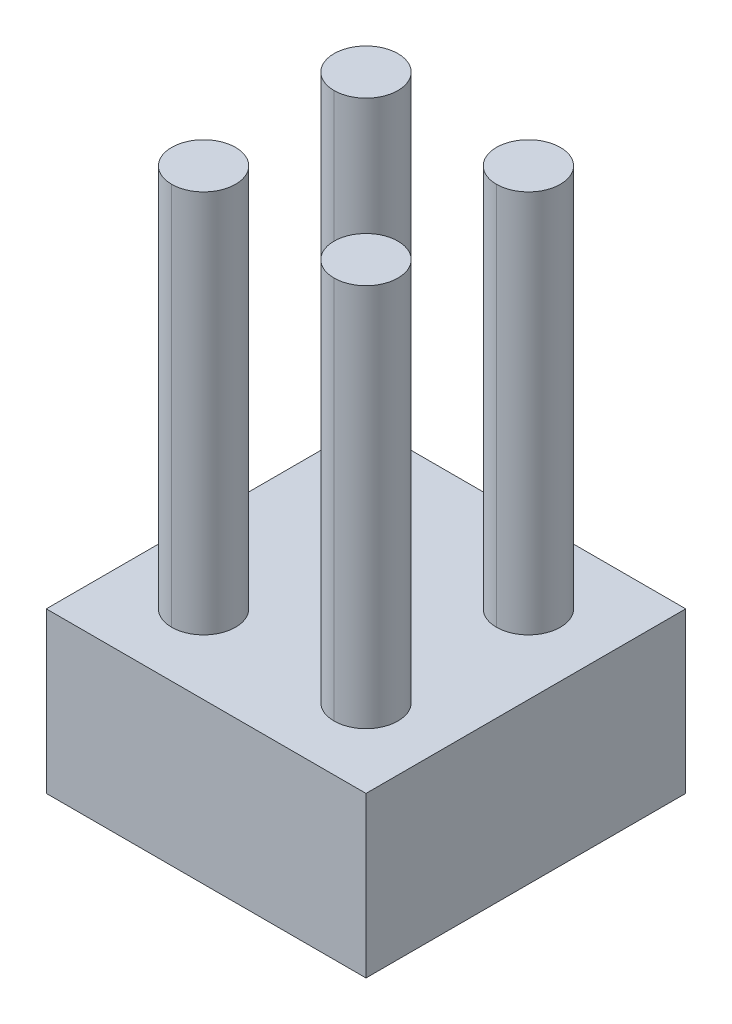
ISO-10303-21;
HEADER;
FILE_DESCRIPTION(('STEP AP214'),'2;1');
FILE_NAME('part.step','',(''),(''),'','','');
FILE_SCHEMA(('AUTOMOTIVE_DESIGN { 1 0 10303 214 1 1 1 1 }'));
ENDSEC;
DATA;
#1=APPLICATION_CONTEXT('core data for automotive mechanical design processes');
#2=APPLICATION_PROTOCOL_DEFINITION('international standard','automotive_design',2000,#1);
#3=PRODUCT_CONTEXT('',#1,'mechanical');
#4=PRODUCT('Part','Part','',(#3));
#5=PRODUCT_RELATED_PRODUCT_CATEGORY('part','',(#4));
#6=PRODUCT_DEFINITION_FORMATION('','',#4);
#7=PRODUCT_DEFINITION_CONTEXT('part definition',#1,'design');
#8=PRODUCT_DEFINITION('design','',#6,#7);
#9=PRODUCT_DEFINITION_SHAPE('','',#8);
#10=(LENGTH_UNIT() NAMED_UNIT(*) SI_UNIT(.MILLI.,.METRE.));
#11=(NAMED_UNIT(*) PLANE_ANGLE_UNIT() SI_UNIT($,.RADIAN.));
#12=(NAMED_UNIT(*) SI_UNIT($,.STERADIAN.) SOLID_ANGLE_UNIT());
#13=UNCERTAINTY_MEASURE_WITH_UNIT(LENGTH_MEASURE(1.E-05),#10,'distance_accuracy_value','');
#14=(GEOMETRIC_REPRESENTATION_CONTEXT(3) GLOBAL_UNCERTAINTY_ASSIGNED_CONTEXT((#13)) GLOBAL_UNIT_ASSIGNED_CONTEXT((#10,
#11,#12)) REPRESENTATION_CONTEXT('',''));
#15=CARTESIAN_POINT('',(0.,0.,0.));
#16=DIRECTION('',(0.,0.,1.));
#17=DIRECTION('',(1.,0.,0.));
#18=AXIS2_PLACEMENT_3D('',#15,#16,#17);
#19=CARTESIAN_POINT('',(1.27,8.5,-1.27));
#20=DIRECTION('',(0.,-1.,0.));
#21=DIRECTION('',(0.,0.,-1.));
#22=AXIS2_PLACEMENT_3D('',#19,#20,#21);
#23=PLANE('',#22);
#24=CARTESIAN_POINT('',(1.27,8.5,-1.27));
#25=DIRECTION('',(0.,1.,0.));
#26=DIRECTION('',(0.,0.,-1.));
#27=AXIS2_PLACEMENT_3D('',#24,#25,#26);
#28=CIRCLE('',#27,0.5);
#29=CARTESIAN_POINT('',(1.27,8.5,-1.77));
#30=VERTEX_POINT('',#29);
#31=CARTESIAN_POINT('',(1.27,8.5,-0.77));
#32=VERTEX_POINT('',#31);
#33=EDGE_CURVE('E11',#30,#32,#28,.T.);
#34=ORIENTED_EDGE('',*,*,#33,.T.);
#35=CARTESIAN_POINT('',(1.27,8.5,-1.27));
#36=DIRECTION('',(0.,1.,0.));
#37=DIRECTION('',(0.,0.,-1.));
#38=AXIS2_PLACEMENT_3D('',#35,#36,#37);
#39=CIRCLE('',#38,0.5);
#40=EDGE_CURVE('E139',#32,#30,#39,.T.);
#41=ORIENTED_EDGE('',*,*,#40,.T.);
#42=EDGE_LOOP('',(#34,#41));
#43=FACE_BOUND('',#42,.T.);
#44=ADVANCED_FACE('F17',(#43),#23,.F.);
#45=CARTESIAN_POINT('',(1.27,8.5,-1.27));
#46=DIRECTION('',(0.,-1.,0.));
#47=DIRECTION('',(0.,0.,-1.));
#48=AXIS2_PLACEMENT_3D('',#45,#46,#47);
#49=CYLINDRICAL_SURFACE('',#48,0.5);
#50=DIRECTION('',(0.,-1.,0.));
#51=VECTOR('',#50,1.);
#52=CARTESIAN_POINT('',(1.27,8.5,-0.77));
#53=LINE('',#52,#51);
#54=CARTESIAN_POINT('',(1.27,2.5,-0.77));
#55=VERTEX_POINT('',#54);
#56=EDGE_CURVE('E144',#32,#55,#53,.T.);
#57=ORIENTED_EDGE('',*,*,#56,.F.);
#58=ORIENTED_EDGE('',*,*,#33,.F.);
#59=DIRECTION('',(0.,-1.,0.));
#60=VECTOR('',#59,1.);
#61=CARTESIAN_POINT('',(1.27,8.5,-1.77));
#62=LINE('',#61,#60);
#63=CARTESIAN_POINT('',(1.27,2.5,-1.77));
#64=VERTEX_POINT('',#63);
#65=EDGE_CURVE('E154',#30,#64,#62,.T.);
#66=ORIENTED_EDGE('',*,*,#65,.T.);
#67=CARTESIAN_POINT('',(1.27,2.5,-1.27));
#68=DIRECTION('',(0.,1.,0.));
#69=DIRECTION('',(0.,0.,-1.));
#70=AXIS2_PLACEMENT_3D('',#67,#68,#69);
#71=CIRCLE('',#70,0.5);
#72=EDGE_CURVE('E146',#64,#55,#71,.T.);
#73=ORIENTED_EDGE('',*,*,#72,.T.);
#74=EDGE_LOOP('',(#57,#58,#66,#73));
#75=FACE_BOUND('',#74,.T.);
#76=ADVANCED_FACE('F145',(#75),#49,.T.);
#77=CARTESIAN_POINT('',(1.27,8.5,1.27));
#78=DIRECTION('',(0.,1.,0.));
#79=DIRECTION('',(1.,0.,0.));
#80=AXIS2_PLACEMENT_3D('',#77,#78,#79);
#81=PLANE('',#80);
#82=CARTESIAN_POINT('',(1.27,8.5,1.27));
#83=DIRECTION('',(0.,1.,0.));
#84=DIRECTION('',(0.,0.,1.));
#85=AXIS2_PLACEMENT_3D('',#82,#83,#84);
#86=CIRCLE('',#85,0.5);
#87=CARTESIAN_POINT('',(1.27,8.5,0.77));
#88=VERTEX_POINT('',#87);
#89=CARTESIAN_POINT('',(1.27,8.5,1.77));
#90=VERTEX_POINT('',#89);
#91=EDGE_CURVE('E25',#88,#90,#86,.T.);
#92=ORIENTED_EDGE('',*,*,#91,.T.);
#93=CARTESIAN_POINT('',(1.27,8.5,1.27));
#94=DIRECTION('',(0.,1.,0.));
#95=DIRECTION('',(0.,0.,1.));
#96=AXIS2_PLACEMENT_3D('',#93,#94,#95);
#97=CIRCLE('',#96,0.5);
#98=EDGE_CURVE('E161',#90,#88,#97,.T.);
#99=ORIENTED_EDGE('',*,*,#98,.T.);
#100=EDGE_LOOP('',(#92,#99));
#101=FACE_BOUND('',#100,.T.);
#102=ADVANCED_FACE('F275',(#101),#81,.T.);
#103=CARTESIAN_POINT('',(1.27,8.5,1.27));
#104=DIRECTION('',(0.,-1.,0.));
#105=DIRECTION('',(0.,0.,-1.));
#106=AXIS2_PLACEMENT_3D('',#103,#104,#105);
#107=CYLINDRICAL_SURFACE('',#106,0.5);
#108=DIRECTION('',(0.,-1.,0.));
#109=VECTOR('',#108,1.);
#110=CARTESIAN_POINT('',(1.27,8.5,1.77));
#111=LINE('',#110,#109);
#112=CARTESIAN_POINT('',(1.27,2.5,1.77));
#113=VERTEX_POINT('',#112);
#114=EDGE_CURVE('E168',#90,#113,#111,.T.);
#115=ORIENTED_EDGE('',*,*,#114,.F.);
#116=ORIENTED_EDGE('',*,*,#91,.F.);
#117=DIRECTION('',(0.,-1.,0.));
#118=VECTOR('',#117,1.);
#119=CARTESIAN_POINT('',(1.27,8.5,0.77));
#120=LINE('',#119,#118);
#121=CARTESIAN_POINT('',(1.27,2.5,0.77));
#122=VERTEX_POINT('',#121);
#123=EDGE_CURVE('E186',#88,#122,#120,.T.);
#124=ORIENTED_EDGE('',*,*,#123,.T.);
#125=CARTESIAN_POINT('',(1.27,2.5,1.27));
#126=DIRECTION('',(0.,1.,0.));
#127=DIRECTION('',(0.,0.,-1.));
#128=AXIS2_PLACEMENT_3D('',#125,#126,#127);
#129=CIRCLE('',#128,0.5);
#130=EDGE_CURVE('E256',#122,#113,#129,.T.);
#131=ORIENTED_EDGE('',*,*,#130,.T.);
#132=EDGE_LOOP('',(#115,#116,#124,#131));
#133=FACE_BOUND('',#132,.T.);
#134=ADVANCED_FACE('F279',(#133),#107,.T.);
#135=CARTESIAN_POINT('',(-1.27,8.5,1.27));
#136=DIRECTION('',(0.,-1.,0.));
#137=DIRECTION('',(0.,0.,-1.));
#138=AXIS2_PLACEMENT_3D('',#135,#136,#137);
#139=PLANE('',#138);
#140=CARTESIAN_POINT('',(-1.27,8.5,1.27));
#141=DIRECTION('',(0.,1.,0.));
#142=DIRECTION('',(0.,0.,-1.));
#143=AXIS2_PLACEMENT_3D('',#140,#141,#142);
#144=CIRCLE('',#143,0.5);
#145=CARTESIAN_POINT('',(-1.27,8.5,0.77));
#146=VERTEX_POINT('',#145);
#147=CARTESIAN_POINT('',(-1.27,8.5,1.77));
#148=VERTEX_POINT('',#147);
#149=EDGE_CURVE('E268',#146,#148,#144,.T.);
#150=ORIENTED_EDGE('',*,*,#149,.T.);
#151=CARTESIAN_POINT('',(-1.27,8.5,1.27));
#152=DIRECTION('',(0.,1.,0.));
#153=DIRECTION('',(0.,0.,-1.));
#154=AXIS2_PLACEMENT_3D('',#151,#152,#153);
#155=CIRCLE('',#154,0.5);
#156=EDGE_CURVE('E190',#148,#146,#155,.T.);
#157=ORIENTED_EDGE('',*,*,#156,.T.);
#158=EDGE_LOOP('',(#150,#157));
#159=FACE_BOUND('',#158,.T.);
#160=ADVANCED_FACE('F324',(#159),#139,.F.);
#161=CARTESIAN_POINT('',(-1.27,8.5,1.27));
#162=DIRECTION('',(0.,-1.,0.));
#163=DIRECTION('',(0.,0.,-1.));
#164=AXIS2_PLACEMENT_3D('',#161,#162,#163);
#165=CYLINDRICAL_SURFACE('',#164,0.5);
#166=DIRECTION('',(0.,-1.,0.));
#167=VECTOR('',#166,1.);
#168=CARTESIAN_POINT('',(-1.27,8.5,1.77));
#169=LINE('',#168,#167);
#170=CARTESIAN_POINT('',(-1.27,2.5,1.77));
#171=VERTEX_POINT('',#170);
#172=EDGE_CURVE('E194',#148,#171,#169,.T.);
#173=ORIENTED_EDGE('',*,*,#172,.F.);
#174=ORIENTED_EDGE('',*,*,#149,.F.);
#175=DIRECTION('',(0.,-1.,0.));
#176=VECTOR('',#175,1.);
#177=CARTESIAN_POINT('',(-1.27,8.5,0.77));
#178=LINE('',#177,#176);
#179=CARTESIAN_POINT('',(-1.27,2.5,0.77));
#180=VERTEX_POINT('',#179);
#181=EDGE_CURVE('E205',#146,#180,#178,.T.);
#182=ORIENTED_EDGE('',*,*,#181,.T.);
#183=CARTESIAN_POINT('',(-1.27,2.5,1.27));
#184=DIRECTION('',(0.,1.,0.));
#185=DIRECTION('',(0.,0.,-1.));
#186=AXIS2_PLACEMENT_3D('',#183,#184,#185);
#187=CIRCLE('',#186,0.5);
#188=EDGE_CURVE('E259',#180,#171,#187,.T.);
#189=ORIENTED_EDGE('',*,*,#188,.T.);
#190=EDGE_LOOP('',(#173,#174,#182,#189));
#191=FACE_BOUND('',#190,.T.);
#192=ADVANCED_FACE('F322',(#191),#165,.T.);
#193=CARTESIAN_POINT('',(-1.27,8.5,-1.27));
#194=DIRECTION('',(0.,1.,0.));
#195=DIRECTION('',(1.,0.,0.));
#196=AXIS2_PLACEMENT_3D('',#193,#194,#195);
#197=PLANE('',#196);
#198=CARTESIAN_POINT('',(-1.27,8.5,-1.27));
#199=DIRECTION('',(0.,1.,0.));
#200=DIRECTION('',(0.,0.,1.));
#201=AXIS2_PLACEMENT_3D('',#198,#199,#200);
#202=CIRCLE('',#201,0.5);
#203=CARTESIAN_POINT('',(-1.27,8.5,-1.77));
#204=VERTEX_POINT('',#203);
#205=CARTESIAN_POINT('',(-1.27,8.5,-0.77));
#206=VERTEX_POINT('',#205);
#207=EDGE_CURVE('E265',#204,#206,#202,.T.);
#208=ORIENTED_EDGE('',*,*,#207,.T.);
#209=CARTESIAN_POINT('',(-1.27,8.5,-1.27));
#210=DIRECTION('',(0.,1.,0.));
#211=DIRECTION('',(0.,0.,1.));
#212=AXIS2_PLACEMENT_3D('',#209,#210,#211);
#213=CIRCLE('',#212,0.5);
#214=EDGE_CURVE('E215',#206,#204,#213,.T.);
#215=ORIENTED_EDGE('',*,*,#214,.T.);
#216=EDGE_LOOP('',(#208,#215));
#217=FACE_BOUND('',#216,.T.);
#218=ADVANCED_FACE('F309',(#217),#197,.T.);
#219=CARTESIAN_POINT('',(-1.27,8.5,-1.27));
#220=DIRECTION('',(0.,-1.,0.));
#221=DIRECTION('',(0.,0.,-1.));
#222=AXIS2_PLACEMENT_3D('',#219,#220,#221);
#223=CYLINDRICAL_SURFACE('',#222,0.5);
#224=DIRECTION('',(0.,-1.,0.));
#225=VECTOR('',#224,1.);
#226=CARTESIAN_POINT('',(-1.27,8.5,-0.77));
#227=LINE('',#226,#225);
#228=CARTESIAN_POINT('',(-1.27,2.5,-0.77));
#229=VERTEX_POINT('',#228);
#230=EDGE_CURVE('E182',#206,#229,#227,.T.);
#231=ORIENTED_EDGE('',*,*,#230,.F.);
#232=ORIENTED_EDGE('',*,*,#207,.F.);
#233=DIRECTION('',(0.,-1.,0.));
#234=VECTOR('',#233,1.);
#235=CARTESIAN_POINT('',(-1.27,8.5,-1.77));
#236=LINE('',#235,#234);
#237=CARTESIAN_POINT('',(-1.27,2.5,-1.77));
#238=VERTEX_POINT('',#237);
#239=EDGE_CURVE('E169',#204,#238,#236,.T.);
#240=ORIENTED_EDGE('',*,*,#239,.T.);
#241=CARTESIAN_POINT('',(-1.27,2.5,-1.27));
#242=DIRECTION('',(0.,1.,0.));
#243=DIRECTION('',(0.,0.,-1.));
#244=AXIS2_PLACEMENT_3D('',#241,#242,#243);
#245=CIRCLE('',#244,0.5);
#246=EDGE_CURVE('E262',#238,#229,#245,.T.);
#247=ORIENTED_EDGE('',*,*,#246,.T.);
#248=EDGE_LOOP('',(#231,#232,#240,#247));
#249=FACE_BOUND('',#248,.T.);
#250=ADVANCED_FACE('F303',(#249),#223,.T.);
#251=CARTESIAN_POINT('',(0.,0.,0.));
#252=DIRECTION('',(0.,-1.,0.));
#253=DIRECTION('',(0.,0.,-1.));
#254=AXIS2_PLACEMENT_3D('',#251,#252,#253);
#255=PLANE('',#254);
#256=DIRECTION('',(0.,0.,-1.));
#257=VECTOR('',#256,1.);
#258=CARTESIAN_POINT('',(2.5,0.,2.5));
#259=LINE('',#258,#257);
#260=CARTESIAN_POINT('',(2.5,0.,2.5));
#261=VERTEX_POINT('',#260);
#262=CARTESIAN_POINT('',(2.5,0.,-2.5));
#263=VERTEX_POINT('',#262);
#264=EDGE_CURVE('E173',#261,#263,#259,.T.);
#265=ORIENTED_EDGE('',*,*,#264,.F.);
#266=DIRECTION('',(1.,0.,0.));
#267=VECTOR('',#266,1.);
#268=CARTESIAN_POINT('',(-2.5,0.,2.5));
#269=LINE('',#268,#267);
#270=CARTESIAN_POINT('',(-2.5,0.,2.5));
#271=VERTEX_POINT('',#270);
#272=EDGE_CURVE('E49',#271,#261,#269,.T.);
#273=ORIENTED_EDGE('',*,*,#272,.F.);
#274=DIRECTION('',(0.,0.,1.));
#275=VECTOR('',#274,1.);
#276=CARTESIAN_POINT('',(-2.5,0.,2.5));
#277=LINE('',#276,#275);
#278=CARTESIAN_POINT('',(-2.5,0.,-2.5));
#279=VERTEX_POINT('',#278);
#280=EDGE_CURVE('E243',#279,#271,#277,.T.);
#281=ORIENTED_EDGE('',*,*,#280,.F.);
#282=DIRECTION('',(-1.,0.,0.));
#283=VECTOR('',#282,1.);
#284=CARTESIAN_POINT('',(-2.5,0.,-2.5));
#285=LINE('',#284,#283);
#286=EDGE_CURVE('E231',#263,#279,#285,.T.);
#287=ORIENTED_EDGE('',*,*,#286,.F.);
#288=EDGE_LOOP('',(#265,#273,#281,#287));
#289=FACE_BOUND('',#288,.T.);
#290=ADVANCED_FACE('F288',(#289),#255,.T.);
#291=CARTESIAN_POINT('',(0.,2.5,0.));
#292=DIRECTION('',(0.,-1.,0.));
#293=DIRECTION('',(0.,0.,-1.));
#294=AXIS2_PLACEMENT_3D('',#291,#292,#293);
#295=PLANE('',#294);
#296=ORIENTED_EDGE('',*,*,#246,.F.);
#297=CARTESIAN_POINT('',(-1.27,2.5,-1.27));
#298=DIRECTION('',(0.,1.,0.));
#299=DIRECTION('',(0.,0.,-1.));
#300=AXIS2_PLACEMENT_3D('',#297,#298,#299);
#301=CIRCLE('',#300,0.5);
#302=EDGE_CURVE('E174',#229,#238,#301,.T.);
#303=ORIENTED_EDGE('',*,*,#302,.F.);
#304=EDGE_LOOP('',(#296,#303));
#305=FACE_BOUND('',#304,.T.);
#306=ORIENTED_EDGE('',*,*,#188,.F.);
#307=CARTESIAN_POINT('',(-1.27,2.5,1.27));
#308=DIRECTION('',(0.,1.,0.));
#309=DIRECTION('',(0.,0.,-1.));
#310=AXIS2_PLACEMENT_3D('',#307,#308,#309);
#311=CIRCLE('',#310,0.5);
#312=EDGE_CURVE('E201',#171,#180,#311,.T.);
#313=ORIENTED_EDGE('',*,*,#312,.F.);
#314=EDGE_LOOP('',(#306,#313));
#315=FACE_BOUND('',#314,.T.);
#316=ORIENTED_EDGE('',*,*,#130,.F.);
#317=CARTESIAN_POINT('',(1.27,2.5,1.27));
#318=DIRECTION('',(0.,1.,0.));
#319=DIRECTION('',(0.,0.,-1.));
#320=AXIS2_PLACEMENT_3D('',#317,#318,#319);
#321=CIRCLE('',#320,0.5);
#322=EDGE_CURVE('E178',#113,#122,#321,.T.);
#323=ORIENTED_EDGE('',*,*,#322,.F.);
#324=EDGE_LOOP('',(#316,#323));
#325=FACE_BOUND('',#324,.T.);
#326=ORIENTED_EDGE('',*,*,#72,.F.);
#327=CARTESIAN_POINT('',(1.27,2.5,-1.27));
#328=DIRECTION('',(0.,1.,0.));
#329=DIRECTION('',(0.,0.,-1.));
#330=AXIS2_PLACEMENT_3D('',#327,#328,#329);
#331=CIRCLE('',#330,0.5);
#332=EDGE_CURVE('E151',#55,#64,#331,.T.);
#333=ORIENTED_EDGE('',*,*,#332,.F.);
#334=EDGE_LOOP('',(#326,#333));
#335=FACE_BOUND('',#334,.T.);
#336=DIRECTION('',(0.,0.,-1.));
#337=VECTOR('',#336,1.);
#338=CARTESIAN_POINT('',(2.5,2.5,2.5));
#339=LINE('',#338,#337);
#340=CARTESIAN_POINT('',(2.5,2.5,2.5));
#341=VERTEX_POINT('',#340);
#342=CARTESIAN_POINT('',(2.5,2.5,-2.5));
#343=VERTEX_POINT('',#342);
#344=EDGE_CURVE('E195',#341,#343,#339,.T.);
#345=ORIENTED_EDGE('',*,*,#344,.T.);
#346=DIRECTION('',(-1.,0.,0.));
#347=VECTOR('',#346,1.);
#348=CARTESIAN_POINT('',(-2.5,2.5,-2.5));
#349=LINE('',#348,#347);
#350=CARTESIAN_POINT('',(-2.5,2.5,-2.5));
#351=VERTEX_POINT('',#350);
#352=EDGE_CURVE('E239',#343,#351,#349,.T.);
#353=ORIENTED_EDGE('',*,*,#352,.T.);
#354=DIRECTION('',(0.,0.,1.));
#355=VECTOR('',#354,1.);
#356=CARTESIAN_POINT('',(-2.5,2.5,2.5));
#357=LINE('',#356,#355);
#358=CARTESIAN_POINT('',(-2.5,2.5,2.5));
#359=VERTEX_POINT('',#358);
#360=EDGE_CURVE('E208',#351,#359,#357,.T.);
#361=ORIENTED_EDGE('',*,*,#360,.T.);
#362=DIRECTION('',(1.,0.,0.));
#363=VECTOR('',#362,1.);
#364=CARTESIAN_POINT('',(-2.5,2.5,2.5));
#365=LINE('',#364,#363);
#366=EDGE_CURVE('E38',#359,#341,#365,.T.);
#367=ORIENTED_EDGE('',*,*,#366,.T.);
#368=EDGE_LOOP('',(#345,#353,#361,#367));
#369=FACE_BOUND('',#368,.T.);
#370=ADVANCED_FACE('F284',(#305,#315,#325,#335,#369),#295,.F.);
#371=CARTESIAN_POINT('',(-2.5,2.5,2.5));
#372=DIRECTION('',(0.,0.,-1.));
#373=DIRECTION('',(0.,-1.,0.));
#374=AXIS2_PLACEMENT_3D('',#371,#372,#373);
#375=PLANE('',#374);
#376=ORIENTED_EDGE('',*,*,#272,.T.);
#377=DIRECTION('',(0.,-1.,0.));
#378=VECTOR('',#377,1.);
#379=CARTESIAN_POINT('',(2.5,2.5,2.5));
#380=LINE('',#379,#378);
#381=EDGE_CURVE('E199',#341,#261,#380,.T.);
#382=ORIENTED_EDGE('',*,*,#381,.F.);
#383=ORIENTED_EDGE('',*,*,#366,.F.);
#384=DIRECTION('',(0.,-1.,0.));
#385=VECTOR('',#384,1.);
#386=CARTESIAN_POINT('',(-2.5,2.5,2.5));
#387=LINE('',#386,#385);
#388=EDGE_CURVE('E247',#359,#271,#387,.T.);
#389=ORIENTED_EDGE('',*,*,#388,.T.);
#390=EDGE_LOOP('',(#376,#382,#383,#389));
#391=FACE_BOUND('',#390,.T.);
#392=ADVANCED_FACE('F287',(#391),#375,.F.);
#393=CARTESIAN_POINT('',(-2.5,2.5,2.5));
#394=DIRECTION('',(1.,0.,0.));
#395=DIRECTION('',(0.,1.,0.));
#396=AXIS2_PLACEMENT_3D('',#393,#394,#395);
#397=PLANE('',#396);
#398=ORIENTED_EDGE('',*,*,#280,.T.);
#399=ORIENTED_EDGE('',*,*,#388,.F.);
#400=ORIENTED_EDGE('',*,*,#360,.F.);
#401=DIRECTION('',(0.,-1.,0.));
#402=VECTOR('',#401,1.);
#403=CARTESIAN_POINT('',(-2.5,2.5,-2.5));
#404=LINE('',#403,#402);
#405=EDGE_CURVE('E235',#351,#279,#404,.T.);
#406=ORIENTED_EDGE('',*,*,#405,.T.);
#407=EDGE_LOOP('',(#398,#399,#400,#406));
#408=FACE_BOUND('',#407,.T.);
#409=ADVANCED_FACE('F300',(#408),#397,.F.);
#410=CARTESIAN_POINT('',(-2.5,2.5,-2.5));
#411=DIRECTION('',(0.,0.,1.));
#412=DIRECTION('',(1.,0.,0.));
#413=AXIS2_PLACEMENT_3D('',#410,#411,#412);
#414=PLANE('',#413);
#415=ORIENTED_EDGE('',*,*,#286,.T.);
#416=ORIENTED_EDGE('',*,*,#405,.F.);
#417=ORIENTED_EDGE('',*,*,#352,.F.);
#418=DIRECTION('',(0.,-1.,0.));
#419=VECTOR('',#418,1.);
#420=CARTESIAN_POINT('',(2.5,2.5,-2.5));
#421=LINE('',#420,#419);
#422=EDGE_CURVE('E200',#343,#263,#421,.T.);
#423=ORIENTED_EDGE('',*,*,#422,.T.);
#424=EDGE_LOOP('',(#415,#416,#417,#423));
#425=FACE_BOUND('',#424,.T.);
#426=ADVANCED_FACE('F298',(#425),#414,.F.);
#427=CARTESIAN_POINT('',(2.5,2.5,2.5));
#428=DIRECTION('',(-1.,0.,0.));
#429=DIRECTION('',(0.,0.,1.));
#430=AXIS2_PLACEMENT_3D('',#427,#428,#429);
#431=PLANE('',#430);
#432=ORIENTED_EDGE('',*,*,#264,.T.);
#433=ORIENTED_EDGE('',*,*,#422,.F.);
#434=ORIENTED_EDGE('',*,*,#344,.F.);
#435=ORIENTED_EDGE('',*,*,#381,.T.);
#436=EDGE_LOOP('',(#432,#433,#434,#435));
#437=FACE_BOUND('',#436,.T.);
#438=ADVANCED_FACE('F296',(#437),#431,.F.);
#439=CARTESIAN_POINT('',(-1.27,8.5,-1.27));
#440=DIRECTION('',(0.,-1.,0.));
#441=DIRECTION('',(0.,0.,-1.));
#442=AXIS2_PLACEMENT_3D('',#439,#440,#441);
#443=CYLINDRICAL_SURFACE('',#442,0.5);
#444=ORIENTED_EDGE('',*,*,#214,.F.);
#445=ORIENTED_EDGE('',*,*,#230,.T.);
#446=ORIENTED_EDGE('',*,*,#302,.T.);
#447=ORIENTED_EDGE('',*,*,#239,.F.);
#448=EDGE_LOOP('',(#444,#445,#446,#447));
#449=FACE_BOUND('',#448,.T.);
#450=ADVANCED_FACE('F335',(#449),#443,.T.);
#451=CARTESIAN_POINT('',(-1.27,8.5,1.27));
#452=DIRECTION('',(0.,-1.,0.));
#453=DIRECTION('',(0.,0.,-1.));
#454=AXIS2_PLACEMENT_3D('',#451,#452,#453);
#455=CYLINDRICAL_SURFACE('',#454,0.5);
#456=ORIENTED_EDGE('',*,*,#156,.F.);
#457=ORIENTED_EDGE('',*,*,#172,.T.);
#458=ORIENTED_EDGE('',*,*,#312,.T.);
#459=ORIENTED_EDGE('',*,*,#181,.F.);
#460=EDGE_LOOP('',(#456,#457,#458,#459));
#461=FACE_BOUND('',#460,.T.);
#462=ADVANCED_FACE('F342',(#461),#455,.T.);
#463=CARTESIAN_POINT('',(1.27,8.5,1.27));
#464=DIRECTION('',(0.,-1.,0.));
#465=DIRECTION('',(0.,0.,-1.));
#466=AXIS2_PLACEMENT_3D('',#463,#464,#465);
#467=CYLINDRICAL_SURFACE('',#466,0.5);
#468=ORIENTED_EDGE('',*,*,#98,.F.);
#469=ORIENTED_EDGE('',*,*,#114,.T.);
#470=ORIENTED_EDGE('',*,*,#322,.T.);
#471=ORIENTED_EDGE('',*,*,#123,.F.);
#472=EDGE_LOOP('',(#468,#469,#470,#471));
#473=FACE_BOUND('',#472,.T.);
#474=ADVANCED_FACE('F282',(#473),#467,.T.);
#475=CARTESIAN_POINT('',(1.27,8.5,-1.27));
#476=DIRECTION('',(0.,-1.,0.));
#477=DIRECTION('',(0.,0.,-1.));
#478=AXIS2_PLACEMENT_3D('',#475,#476,#477);
#479=CYLINDRICAL_SURFACE('',#478,0.5);
#480=ORIENTED_EDGE('',*,*,#40,.F.);
#481=ORIENTED_EDGE('',*,*,#56,.T.);
#482=ORIENTED_EDGE('',*,*,#332,.T.);
#483=ORIENTED_EDGE('',*,*,#65,.F.);
#484=EDGE_LOOP('',(#480,#481,#482,#483));
#485=FACE_BOUND('',#484,.T.);
#486=ADVANCED_FACE('F153',(#485),#479,.T.);
#487=CLOSED_SHELL('',(#44,#76,#102,#134,#160,#192,#218,#250,#290,#370,#392,#409,#426,#438,#450,
#462,#474,#486));
#488=MANIFOLD_SOLID_BREP('B1',#487);
#489=ADVANCED_BREP_SHAPE_REPRESENTATION('',(#18,#488),#14);
#490=SHAPE_DEFINITION_REPRESENTATION(#9,#489);
ENDSEC;
END-ISO-10303-21;
